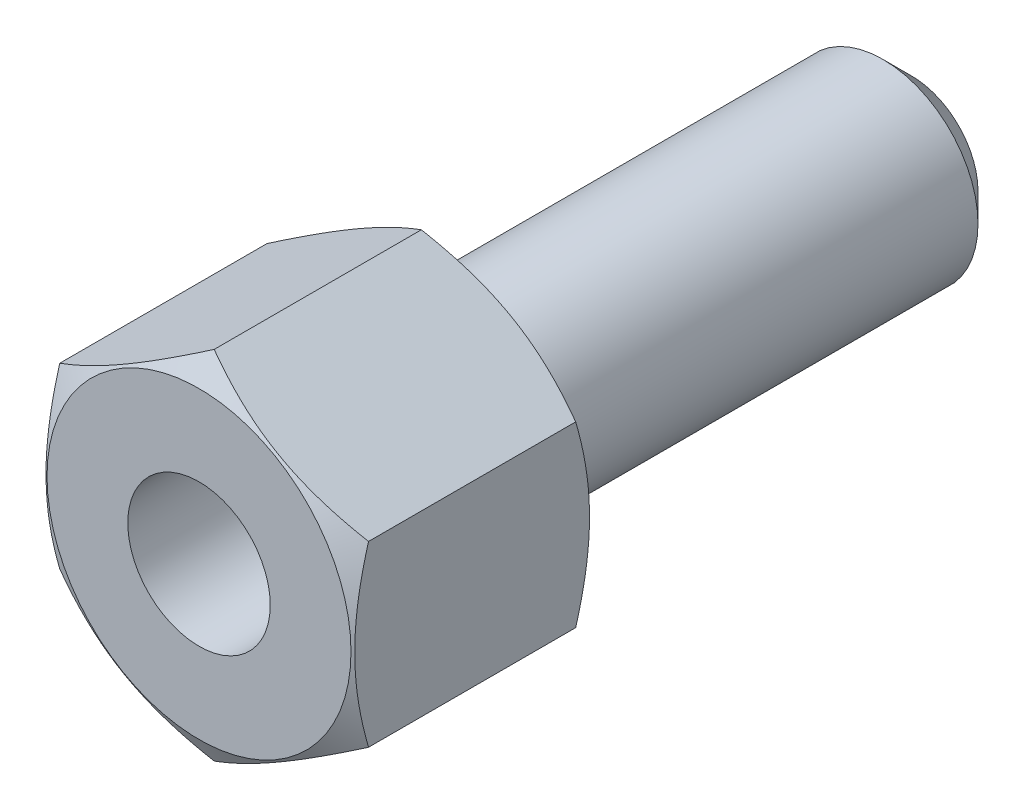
ISO-10303-21;
HEADER;
FILE_DESCRIPTION(('STEP AP214'),'2;1');
FILE_NAME('part.step','',(''),(''),'','','');
FILE_SCHEMA(('AUTOMOTIVE_DESIGN { 1 0 10303 214 1 1 1 1 }'));
ENDSEC;
DATA;
#1=APPLICATION_CONTEXT('core data for automotive mechanical design processes');
#2=APPLICATION_PROTOCOL_DEFINITION('international standard','automotive_design',2000,#1);
#3=PRODUCT_CONTEXT('',#1,'mechanical');
#4=PRODUCT('Part','Part','',(#3));
#5=PRODUCT_RELATED_PRODUCT_CATEGORY('part','',(#4));
#6=PRODUCT_DEFINITION_FORMATION('','',#4);
#7=PRODUCT_DEFINITION_CONTEXT('part definition',#1,'design');
#8=PRODUCT_DEFINITION('design','',#6,#7);
#9=PRODUCT_DEFINITION_SHAPE('','',#8);
#10=(LENGTH_UNIT() NAMED_UNIT(*) SI_UNIT(.MILLI.,.METRE.));
#11=(NAMED_UNIT(*) PLANE_ANGLE_UNIT() SI_UNIT($,.RADIAN.));
#12=(NAMED_UNIT(*) SI_UNIT($,.STERADIAN.) SOLID_ANGLE_UNIT());
#13=UNCERTAINTY_MEASURE_WITH_UNIT(LENGTH_MEASURE(1.E-05),#10,'distance_accuracy_value','');
#14=(GEOMETRIC_REPRESENTATION_CONTEXT(3) GLOBAL_UNCERTAINTY_ASSIGNED_CONTEXT((#13)) GLOBAL_UNIT_ASSIGNED_CONTEXT((#10,
#11,#12)) REPRESENTATION_CONTEXT('',''));
#15=CARTESIAN_POINT('',(0.,0.,0.));
#16=DIRECTION('',(0.,0.,1.));
#17=DIRECTION('',(1.,0.,0.));
#18=AXIS2_PLACEMENT_3D('',#15,#16,#17);
#19=CARTESIAN_POINT('',(-6.5,11.2583302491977,10.));
#20=DIRECTION('',(0.,0.,1.));
#21=DIRECTION('',(1.,0.,0.));
#22=AXIS2_PLACEMENT_3D('',#19,#20,#21);
#23=PLANE('',#22);
#24=CARTESIAN_POINT('',(0.,0.,10.));
#25=DIRECTION('',(0.,0.,-1.));
#26=DIRECTION('',(-1.,0.,0.));
#27=AXIS2_PLACEMENT_3D('',#24,#25,#26);
#28=CIRCLE('',#27,6.4);
#29=CARTESIAN_POINT('',(-6.4,0.,10.));
#30=VERTEX_POINT('',#29);
#31=EDGE_CURVE('E223',#30,#30,#28,.T.);
#32=ORIENTED_EDGE('',*,*,#31,.F.);
#33=EDGE_LOOP('',(#32));
#34=FACE_BOUND('',#33,.T.);
#35=CARTESIAN_POINT('',(0.,0.,10.));
#36=DIRECTION('',(0.,0.,1.));
#37=DIRECTION('',(1.,0.,0.));
#38=AXIS2_PLACEMENT_3D('',#35,#36,#37);
#39=CIRCLE('',#38,3.);
#40=CARTESIAN_POINT('',(3.,0.,10.));
#41=VERTEX_POINT('',#40);
#42=EDGE_CURVE('E211',#41,#41,#39,.T.);
#43=ORIENTED_EDGE('',*,*,#42,.F.);
#44=EDGE_LOOP('',(#43));
#45=FACE_BOUND('',#44,.T.);
#46=ADVANCED_FACE('F14',(#34,#45),#23,.T.);
#47=CARTESIAN_POINT('',(2.5,0.,4.));
#48=DIRECTION('',(0.,0.,-1.));
#49=DIRECTION('',(-1.,0.,0.));
#50=AXIS2_PLACEMENT_3D('',#47,#48,#49);
#51=PLANE('',#50);
#52=CARTESIAN_POINT('',(0.,0.,4.));
#53=DIRECTION('',(0.,0.,1.));
#54=DIRECTION('',(1.,0.,0.));
#55=AXIS2_PLACEMENT_3D('',#52,#53,#54);
#56=CIRCLE('',#55,3.);
#57=CARTESIAN_POINT('',(3.,0.,4.));
#58=VERTEX_POINT('',#57);
#59=EDGE_CURVE('E214',#58,#58,#56,.T.);
#60=ORIENTED_EDGE('',*,*,#59,.T.);
#61=EDGE_LOOP('',(#60));
#62=FACE_BOUND('',#61,.T.);
#63=ADVANCED_FACE('F230',(#62),#51,.F.);
#64=CARTESIAN_POINT('',(0.,0.,10.));
#65=DIRECTION('',(0.,0.,1.));
#66=DIRECTION('',(1.,0.,0.));
#67=AXIS2_PLACEMENT_3D('',#64,#65,#66);
#68=CYLINDRICAL_SURFACE('',#67,3.);
#69=ORIENTED_EDGE('',*,*,#59,.F.);
#70=EDGE_LOOP('',(#69));
#71=FACE_BOUND('',#70,.T.);
#72=ORIENTED_EDGE('',*,*,#42,.T.);
#73=EDGE_LOOP('',(#72));
#74=FACE_BOUND('',#73,.T.);
#75=ADVANCED_FACE('F233',(#71,#74),#68,.F.);
#76=CARTESIAN_POINT('',(0.,0.,10.));
#77=DIRECTION('',(0.,0.,-1.));
#78=DIRECTION('',(-1.,0.,0.));
#79=AXIS2_PLACEMENT_3D('',#76,#77,#78);
#80=CONICAL_SURFACE('',#79,6.4,1.0471975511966);
#81=ORIENTED_EDGE('',*,*,#31,.T.);
#82=EDGE_LOOP('',(#81));
#83=FACE_BOUND('',#82,.T.);
#84=CARTESIAN_POINT('',(6.5002,-3.75266127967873,9.36164172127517));
#85=CARTESIAN_POINT('',(6.35732254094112,-3.83515161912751,9.40926055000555));
#86=CARTESIAN_POINT('',(6.21391236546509,-3.91794952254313,9.45471827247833));
#87=CARTESIAN_POINT('',(5.9259273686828,-4.08421773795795,9.54071629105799));
#88=CARTESIAN_POINT('',(5.78135207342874,-4.16768832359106,9.58125446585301));
#89=CARTESIAN_POINT('',(5.34531134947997,-4.41943655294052,9.69469397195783));
#90=CARTESIAN_POINT('',(5.05212471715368,-4.5887079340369,9.7592171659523));
#91=CARTESIAN_POINT('',(4.61337625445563,-4.84201947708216,9.83487838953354));
#92=CARTESIAN_POINT('',(4.46912536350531,-4.92530276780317,9.85643211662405));
#93=CARTESIAN_POINT('',(4.17997178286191,-5.09224566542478,9.89257465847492));
#94=CARTESIAN_POINT('',(4.03506915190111,-5.17590523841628,9.90716408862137));
#95=CARTESIAN_POINT('',(3.74501222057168,-5.34336968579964,9.92900622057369));
#96=CARTESIAN_POINT('',(3.59985839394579,-5.427174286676,9.93626724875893));
#97=CARTESIAN_POINT('',(3.30942466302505,-5.59485627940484,9.9433046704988));
#98=CARTESIAN_POINT('',(3.16414476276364,-5.67873366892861,9.94308129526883));
#99=CARTESIAN_POINT('',(2.76612405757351,-5.90853103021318,9.93218151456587));
#100=CARTESIAN_POINT('',(2.51351353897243,-6.05437578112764,9.91388315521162));
#101=CARTESIAN_POINT('',(2.00997032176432,-6.34509659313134,9.85585863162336));
#102=CARTESIAN_POINT('',(1.75903939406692,-6.48997163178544,9.81611263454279));
#103=CARTESIAN_POINT('',(1.25448277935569,-6.78127752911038,9.71675906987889));
#104=CARTESIAN_POINT('',(1.0009207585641,-6.92767163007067,9.65673054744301));
#105=CARTESIAN_POINT('',(0.497578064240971,-7.21827667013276,9.52048998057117));
#106=CARTESIAN_POINT('',(0.247790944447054,-7.36249133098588,9.44430993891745));
#107=CARTESIAN_POINT('',(-0.000199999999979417,-7.50566896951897,9.36164172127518));
#108=B_SPLINE_CURVE_WITH_KNOTS('',3,(#84,#85,#86,#87,#88,#89,#90,#91,#92,#93,#94,#95,#96,#97,
#98,#99,#100,#101,#102,#103,#104,#105,#106,#107),.UNSPECIFIED.,.F.,.F.,(4,2,2,2,2,2,2,2,2,2,2,
4),(0.,0.515105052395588,1.03043143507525,2.06322554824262,2.56697389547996,3.07067772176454,
3.57380860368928,4.0769239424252,4.9527935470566,5.82947446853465,6.72559912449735,
7.61996451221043),.UNSPECIFIED.);
#109=CARTESIAN_POINT('',(6.5,-3.75277674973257,9.36170838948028));
#110=VERTEX_POINT('',#109);
#111=CARTESIAN_POINT('',(0.,-7.50555349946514,9.36170838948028));
#112=VERTEX_POINT('',#111);
#113=EDGE_CURVE('E168',#110,#112,#108,.T.);
#114=ORIENTED_EDGE('',*,*,#113,.F.);
#115=CARTESIAN_POINT('',(6.5,-10.251609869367,6.68682024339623));
#116=CARTESIAN_POINT('',(6.5,-9.96623432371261,6.82593262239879));
#117=CARTESIAN_POINT('',(6.5,-9.68022178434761,6.96375977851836));
#118=CARTESIAN_POINT('',(6.5,-9.10658461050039,7.2361240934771));
#119=CARTESIAN_POINT('',(6.5,-8.81895974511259,7.37066076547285));
#120=CARTESIAN_POINT('',(6.5,-8.24035824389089,7.63636529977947));
#121=CARTESIAN_POINT('',(6.5,-7.94937197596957,7.76751225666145));
#122=CARTESIAN_POINT('',(6.5,-7.36514418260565,8.02466325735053));
#123=CARTESIAN_POINT('',(6.5,-7.07190275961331,8.15066753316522));
#124=CARTESIAN_POINT('',(6.5,-6.47259222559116,8.40039237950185));
#125=CARTESIAN_POINT('',(6.5,-6.16642817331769,8.52388629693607));
#126=CARTESIAN_POINT('',(6.5,-5.55058155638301,8.76193539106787));
#127=CARTESIAN_POINT('',(6.5,-5.24089861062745,8.87648958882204));
#128=CARTESIAN_POINT('',(6.5,-4.61804913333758,9.0937769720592));
#129=CARTESIAN_POINT('',(6.5,-4.30489053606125,9.19653268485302));
#130=CARTESIAN_POINT('',(6.5,-3.67408052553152,9.38703841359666));
#131=CARTESIAN_POINT('',(6.5,-3.35643050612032,9.4747929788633));
#132=CARTESIAN_POINT('',(6.5,-2.71827452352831,9.63072575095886));
#133=CARTESIAN_POINT('',(6.5,-2.39779647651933,9.69901642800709));
#134=CARTESIAN_POINT('',(6.5,-1.75263546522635,9.81227512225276));
#135=CARTESIAN_POINT('',(6.5,-1.42795295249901,9.85724562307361));
#136=CARTESIAN_POINT('',(6.5,-0.941234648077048,9.90423394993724));
#137=CARTESIAN_POINT('',(6.5,-0.780147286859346,9.91646993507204));
#138=CARTESIAN_POINT('',(6.5,-0.457592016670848,9.93411753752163));
#139=CARTESIAN_POINT('',(6.5,-0.296124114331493,9.93952927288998));
#140=CARTESIAN_POINT('',(6.5,0.026894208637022,9.94339126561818));
#141=CARTESIAN_POINT('',(6.5,0.188444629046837,9.94184154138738));
#142=CARTESIAN_POINT('',(6.5,0.511333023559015,9.93182234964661));
#143=CARTESIAN_POINT('',(6.5,0.672670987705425,9.92335256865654));
#144=CARTESIAN_POINT('',(6.5,1.05534602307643,9.89523890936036));
#145=CARTESIAN_POINT('',(6.5,1.27646767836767,9.87259368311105));
#146=CARTESIAN_POINT('',(6.5,1.71717009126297,9.81550155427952));
#147=CARTESIAN_POINT('',(6.5,1.93675065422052,9.78105318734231));
#148=CARTESIAN_POINT('',(6.5,2.59287335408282,9.66182153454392));
#149=CARTESIAN_POINT('',(6.5,3.02657572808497,9.5611701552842));
#150=CARTESIAN_POINT('',(6.5,3.67531997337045,9.38535013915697));
#151=CARTESIAN_POINT('',(6.5,3.89369135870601,9.32174856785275));
#152=CARTESIAN_POINT('',(6.5,4.32831695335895,9.18761755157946));
#153=CARTESIAN_POINT('',(6.5,4.54457114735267,9.11708805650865));
#154=CARTESIAN_POINT('',(6.49999999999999,4.9750244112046,8.97025924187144));
#155=CARTESIAN_POINT('',(6.49999999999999,5.18922405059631,8.89396157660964));
#156=CARTESIAN_POINT('',(6.5,5.61582712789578,8.73652606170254));
#157=CARTESIAN_POINT('',(6.5,5.82823059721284,8.65538829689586));
#158=CARTESIAN_POINT('',(6.5,6.36609708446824,8.44401186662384));
#159=CARTESIAN_POINT('',(6.5,6.69046427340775,8.31098844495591));
#160=CARTESIAN_POINT('',(6.49999999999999,7.33609679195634,8.03759124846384));
#161=CARTESIAN_POINT('',(6.49999999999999,7.6573618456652,7.89721682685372));
#162=CARTESIAN_POINT('',(6.49999999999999,8.29743608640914,7.61072908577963));
#163=CARTESIAN_POINT('',(6.49999999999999,8.61624446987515,7.46461397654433));
#164=CARTESIAN_POINT('',(6.49999999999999,9.25175710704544,7.1679164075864));
#165=CARTESIAN_POINT('',(6.49999999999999,9.5684614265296,7.01733408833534));
#166=CARTESIAN_POINT('',(6.49999999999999,10.2005930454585,6.71239901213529));
#167=CARTESIAN_POINT('',(6.49999999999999,10.5160179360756,6.55804127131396));
#168=CARTESIAN_POINT('',(6.49999999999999,11.1454419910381,6.24644601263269));
#169=CARTESIAN_POINT('',(6.49999999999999,11.4594411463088,6.08920847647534));
#170=CARTESIAN_POINT('',(6.49999999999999,12.3995576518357,5.61406130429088));
#171=CARTESIAN_POINT('',(6.49999999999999,13.0239100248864,5.29266063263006));
#172=CARTESIAN_POINT('',(6.49999999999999,14.2096861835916,4.67456421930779));
#173=CARTESIAN_POINT('',(6.49999999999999,14.7714135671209,4.37844811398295));
#174=CARTESIAN_POINT('',(6.49999999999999,15.8928454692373,3.78234532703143));
#175=CARTESIAN_POINT('',(6.49999999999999,16.4525498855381,3.48235845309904));
#176=CARTESIAN_POINT('',(6.49999999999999,17.5686872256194,2.88040486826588));
#177=CARTESIAN_POINT('',(6.49999999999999,18.1251249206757,2.57844698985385));
#178=CARTESIAN_POINT('',(6.49999999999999,19.2367261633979,1.97228506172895));
#179=CARTESIAN_POINT('',(6.49999999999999,19.7918897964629,1.66808116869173));
#180=CARTESIAN_POINT('',(6.5,20.3465961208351,1.36305116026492));
#181=B_SPLINE_CURVE_WITH_KNOTS('',3,(#115,#116,#117,#118,#119,#120,#121,#122,#123,#124,#125,
#126,#127,#128,#129,#130,#131,#132,#133,#134,#135,#136,#137,#138,#139,#140,#141,#142,#143,#144,
#145,#146,#147,#148,#149,#150,#151,#152,#153,#154,#155,#156,#157,#158,#159,#160,#161,#162,#163,
#164,#165,#166,#167,#168,#169,#170,#171,#172,#173,#174,#175,#176,#177,#178,#179,#180),
.UNSPECIFIED.,.F.,.F.,(4,2,2,2,2,2,2,2,2,2,2,2,2,2,2,2,2,2,2,2,2,2,2,2,2,2,2,2,2,2,2,2,4),(0.,
0.952440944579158,1.90502196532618,2.86250633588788,3.81994746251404,4.81023576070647,
5.80063234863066,6.78910533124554,7.77727801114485,8.75961916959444,9.74185568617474,
10.2263873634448,10.7109106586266,11.1954326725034,11.6799766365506,12.3464382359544,
13.0129825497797,14.3467327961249,15.0290060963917,15.7112843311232,16.3933676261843,
17.0754389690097,18.1270626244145,19.1787789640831,20.2308258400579,21.2828396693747,
22.336326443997,23.3898199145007,25.4964198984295,27.4013980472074,29.3064712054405,
31.2057322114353,33.1048619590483),.UNSPECIFIED.);
#182=CARTESIAN_POINT('',(6.5,3.75277674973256,9.36170838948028));
#183=VERTEX_POINT('',#182);
#184=EDGE_CURVE('E159',#183,#110,#181,.F.);
#185=ORIENTED_EDGE('',*,*,#184,.F.);
#186=CARTESIAN_POINT('',(-0.000200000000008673,7.50566896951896,9.36164172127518));
#187=CARTESIAN_POINT('',(0.142677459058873,7.42317863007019,9.40926055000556));
#188=CARTESIAN_POINT('',(0.286087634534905,7.34038072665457,9.45471827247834));
#189=CARTESIAN_POINT('',(0.574072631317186,7.17411251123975,9.540716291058));
#190=CARTESIAN_POINT('',(0.718647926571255,7.09064192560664,9.58125446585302));
#191=CARTESIAN_POINT('',(1.15468865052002,6.83889369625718,9.69469397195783));
#192=CARTESIAN_POINT('',(1.44787528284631,6.6696223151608,9.7592171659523));
#193=CARTESIAN_POINT('',(1.88662374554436,6.41631077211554,9.83487838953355));
#194=CARTESIAN_POINT('',(2.03087463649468,6.33302748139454,9.85643211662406));
#195=CARTESIAN_POINT('',(2.32002821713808,6.16608458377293,9.89257465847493));
#196=CARTESIAN_POINT('',(2.46493084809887,6.08242501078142,9.90716408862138));
#197=CARTESIAN_POINT('',(2.7549877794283,5.91496056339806,9.9290062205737));
#198=CARTESIAN_POINT('',(2.90014160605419,5.8311559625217,9.93626724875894));
#199=CARTESIAN_POINT('',(3.19057533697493,5.66347396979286,9.94330467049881));
#200=CARTESIAN_POINT('',(3.33585523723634,5.5795965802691,9.94308129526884));
#201=CARTESIAN_POINT('',(3.73387594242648,5.34979921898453,9.93218151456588));
#202=CARTESIAN_POINT('',(3.98648646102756,5.20395446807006,9.91388315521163));
#203=CARTESIAN_POINT('',(4.49002967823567,4.91323365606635,9.85585863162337));
#204=CARTESIAN_POINT('',(4.74096060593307,4.76835861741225,9.8161126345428));
#205=CARTESIAN_POINT('',(5.24551722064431,4.47705272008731,9.7167590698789));
#206=CARTESIAN_POINT('',(5.49907924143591,4.33065861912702,9.65673054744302));
#207=CARTESIAN_POINT('',(6.00242193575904,4.04005357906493,9.52048998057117));
#208=CARTESIAN_POINT('',(6.25220905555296,3.89583891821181,9.44430993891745));
#209=CARTESIAN_POINT('',(6.5002,3.75266127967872,9.36164172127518));
#210=B_SPLINE_CURVE_WITH_KNOTS('',3,(#186,#187,#188,#189,#190,#191,#192,#193,#194,#195,#196,
#197,#198,#199,#200,#201,#202,#203,#204,#205,#206,#207,#208,#209),.UNSPECIFIED.,.F.,.F.,(4,2,2,
2,2,2,2,2,2,2,2,4),(0.,0.515105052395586,1.03043143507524,2.06322554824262,2.56697389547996,
3.07067772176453,3.57380860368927,4.07692394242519,4.95279354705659,5.82947446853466,
6.72559912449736,7.61996451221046),.UNSPECIFIED.);
#211=CARTESIAN_POINT('',(0.,7.50555349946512,9.36170838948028));
#212=VERTEX_POINT('',#211);
#213=EDGE_CURVE('E167',#212,#183,#210,.T.);
#214=ORIENTED_EDGE('',*,*,#213,.F.);
#215=CARTESIAN_POINT('',(-6.5002,3.75266127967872,9.36164172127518));
#216=CARTESIAN_POINT('',(-6.35732254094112,3.83515161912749,9.40926055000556));
#217=CARTESIAN_POINT('',(-6.21391236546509,3.91794952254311,9.45471827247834));
#218=CARTESIAN_POINT('',(-5.9259273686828,4.08421773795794,9.540716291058));
#219=CARTESIAN_POINT('',(-5.78135207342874,4.16768832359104,9.58125446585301));
#220=CARTESIAN_POINT('',(-5.34531134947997,4.4194365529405,9.69469397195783));
#221=CARTESIAN_POINT('',(-5.05212471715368,4.58870793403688,9.7592171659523));
#222=CARTESIAN_POINT('',(-4.61337625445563,4.84201947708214,9.83487838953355));
#223=CARTESIAN_POINT('',(-4.46912536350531,4.92530276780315,9.85643211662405));
#224=CARTESIAN_POINT('',(-4.17997178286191,5.09224566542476,9.89257465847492));
#225=CARTESIAN_POINT('',(-4.03506915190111,5.17590523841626,9.90716408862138));
#226=CARTESIAN_POINT('',(-3.74501222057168,5.34336968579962,9.9290062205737));
#227=CARTESIAN_POINT('',(-3.59985839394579,5.42717428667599,9.93626724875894));
#228=CARTESIAN_POINT('',(-3.30942466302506,5.59485627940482,9.94330467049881));
#229=CARTESIAN_POINT('',(-3.16414476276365,5.67873366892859,9.94308129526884));
#230=CARTESIAN_POINT('',(-2.76612405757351,5.90853103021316,9.93218151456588));
#231=CARTESIAN_POINT('',(-2.51351353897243,6.05437578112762,9.91388315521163));
#232=CARTESIAN_POINT('',(-2.00997032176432,6.34509659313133,9.85585863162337));
#233=CARTESIAN_POINT('',(-1.75903939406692,6.48997163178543,9.8161126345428));
#234=CARTESIAN_POINT('',(-1.25448277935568,6.78127752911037,9.7167590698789));
#235=CARTESIAN_POINT('',(-1.00092075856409,6.92767163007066,9.65673054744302));
#236=CARTESIAN_POINT('',(-0.49757806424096,7.21827667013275,9.52048998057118));
#237=CARTESIAN_POINT('',(-0.247790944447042,7.36249133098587,9.44430993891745));
#238=CARTESIAN_POINT('',(0.000199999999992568,7.50566896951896,9.36164172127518));
#239=B_SPLINE_CURVE_WITH_KNOTS('',3,(#215,#216,#217,#218,#219,#220,#221,#222,#223,#224,#225,
#226,#227,#228,#229,#230,#231,#232,#233,#234,#235,#236,#237,#238),.UNSPECIFIED.,.F.,.F.,(4,2,2,
2,2,2,2,2,2,2,2,4),(0.,0.515105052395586,1.03043143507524,2.06322554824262,2.56697389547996,
3.07067772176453,3.57380860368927,4.07692394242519,4.95279354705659,5.82947446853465,
6.72559912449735,7.61996451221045),.UNSPECIFIED.);
#240=CARTESIAN_POINT('',(-6.5,3.75277674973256,9.36170838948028));
#241=VERTEX_POINT('',#240);
#242=EDGE_CURVE('E179',#241,#212,#239,.T.);
#243=ORIENTED_EDGE('',*,*,#242,.F.);
#244=CARTESIAN_POINT('',(-6.5,-10.251609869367,6.68682024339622));
#245=CARTESIAN_POINT('',(-6.5,-9.96623432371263,6.82593262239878));
#246=CARTESIAN_POINT('',(-6.50000000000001,-9.68022178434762,6.96375977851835));
#247=CARTESIAN_POINT('',(-6.50000000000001,-9.10658461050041,7.23612409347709));
#248=CARTESIAN_POINT('',(-6.50000000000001,-8.81895974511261,7.37066076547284));
#249=CARTESIAN_POINT('',(-6.50000000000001,-8.2403582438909,7.63636529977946));
#250=CARTESIAN_POINT('',(-6.50000000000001,-7.94937197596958,7.76751225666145));
#251=CARTESIAN_POINT('',(-6.50000000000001,-7.36514418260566,8.02466325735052));
#252=CARTESIAN_POINT('',(-6.50000000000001,-7.07190275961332,8.15066753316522));
#253=CARTESIAN_POINT('',(-6.50000000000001,-6.47259222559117,8.40039237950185));
#254=CARTESIAN_POINT('',(-6.5,-6.1664281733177,8.52388629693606));
#255=CARTESIAN_POINT('',(-6.5,-5.55058155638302,8.76193539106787));
#256=CARTESIAN_POINT('',(-6.5,-5.24089861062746,8.87648958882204));
#257=CARTESIAN_POINT('',(-6.5,-4.61804913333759,9.09377697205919));
#258=CARTESIAN_POINT('',(-6.5,-4.30489053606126,9.19653268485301));
#259=CARTESIAN_POINT('',(-6.5,-3.67408052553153,9.38703841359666));
#260=CARTESIAN_POINT('',(-6.5,-3.35643050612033,9.4747929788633));
#261=CARTESIAN_POINT('',(-6.5,-2.71827452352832,9.63072575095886));
#262=CARTESIAN_POINT('',(-6.5,-2.39779647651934,9.69901642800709));
#263=CARTESIAN_POINT('',(-6.5,-1.75263546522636,9.81227512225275));
#264=CARTESIAN_POINT('',(-6.5,-1.42795295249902,9.85724562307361));
#265=CARTESIAN_POINT('',(-6.5,-0.941234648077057,9.90423394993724));
#266=CARTESIAN_POINT('',(-6.5,-0.780147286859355,9.91646993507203));
#267=CARTESIAN_POINT('',(-6.5,-0.457592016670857,9.93411753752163));
#268=CARTESIAN_POINT('',(-6.5,-0.296124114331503,9.93952927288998));
#269=CARTESIAN_POINT('',(-6.5,0.026894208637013,9.94339126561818));
#270=CARTESIAN_POINT('',(-6.5,0.188444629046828,9.94184154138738));
#271=CARTESIAN_POINT('',(-6.5,0.511333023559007,9.9318223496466));
#272=CARTESIAN_POINT('',(-6.5,0.672670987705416,9.92335256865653));
#273=CARTESIAN_POINT('',(-6.5,1.05534602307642,9.89523890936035));
#274=CARTESIAN_POINT('',(-6.5,1.27646767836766,9.87259368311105));
#275=CARTESIAN_POINT('',(-6.5,1.71717009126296,9.81550155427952));
#276=CARTESIAN_POINT('',(-6.5,1.93675065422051,9.78105318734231));
#277=CARTESIAN_POINT('',(-6.5,2.59287335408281,9.66182153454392));
#278=CARTESIAN_POINT('',(-6.5,3.02657572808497,9.5611701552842));
#279=CARTESIAN_POINT('',(-6.5,3.67531997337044,9.38535013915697));
#280=CARTESIAN_POINT('',(-6.5,3.89369135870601,9.32174856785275));
#281=CARTESIAN_POINT('',(-6.5,4.32831695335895,9.18761755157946));
#282=CARTESIAN_POINT('',(-6.5,4.54457114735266,9.11708805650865));
#283=CARTESIAN_POINT('',(-6.5,4.97502441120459,8.97025924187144));
#284=CARTESIAN_POINT('',(-6.5,5.1892240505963,8.89396157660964));
#285=CARTESIAN_POINT('',(-6.5,5.61582712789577,8.73652606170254));
#286=CARTESIAN_POINT('',(-6.5,5.82823059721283,8.65538829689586));
#287=CARTESIAN_POINT('',(-6.5,6.36609708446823,8.44401186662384));
#288=CARTESIAN_POINT('',(-6.5,6.69046427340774,8.31098844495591));
#289=CARTESIAN_POINT('',(-6.5,7.33609679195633,8.03759124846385));
#290=CARTESIAN_POINT('',(-6.5,7.65736184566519,7.89721682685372));
#291=CARTESIAN_POINT('',(-6.5,8.29743608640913,7.61072908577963));
#292=CARTESIAN_POINT('',(-6.5,8.61624446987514,7.46461397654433));
#293=CARTESIAN_POINT('',(-6.5,9.25175710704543,7.16791640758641));
#294=CARTESIAN_POINT('',(-6.5,9.56846142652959,7.01733408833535));
#295=CARTESIAN_POINT('',(-6.5,10.2005930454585,6.7123990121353));
#296=CARTESIAN_POINT('',(-6.5,10.5160179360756,6.55804127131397));
#297=CARTESIAN_POINT('',(-6.5,11.1454419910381,6.2464460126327));
#298=CARTESIAN_POINT('',(-6.5,11.4594411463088,6.08920847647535));
#299=CARTESIAN_POINT('',(-6.5,12.3995576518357,5.61406130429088));
#300=CARTESIAN_POINT('',(-6.5,13.0239100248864,5.29266063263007));
#301=CARTESIAN_POINT('',(-6.5,14.2096861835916,4.6745642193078));
#302=CARTESIAN_POINT('',(-6.49999999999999,14.7714135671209,4.37844811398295));
#303=CARTESIAN_POINT('',(-6.49999999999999,15.8928454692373,3.78234532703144));
#304=CARTESIAN_POINT('',(-6.49999999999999,16.4525498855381,3.48235845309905));
#305=CARTESIAN_POINT('',(-6.49999999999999,17.5686872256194,2.88040486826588));
#306=CARTESIAN_POINT('',(-6.49999999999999,18.1251249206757,2.57844698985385));
#307=CARTESIAN_POINT('',(-6.49999999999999,19.2367261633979,1.97228506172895));
#308=CARTESIAN_POINT('',(-6.5,19.7918897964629,1.66808116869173));
#309=CARTESIAN_POINT('',(-6.5,20.3465961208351,1.36305116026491));
#310=B_SPLINE_CURVE_WITH_KNOTS('',3,(#244,#245,#246,#247,#248,#249,#250,#251,#252,#253,#254,
#255,#256,#257,#258,#259,#260,#261,#262,#263,#264,#265,#266,#267,#268,#269,#270,#271,#272,#273,
#274,#275,#276,#277,#278,#279,#280,#281,#282,#283,#284,#285,#286,#287,#288,#289,#290,#291,#292,
#293,#294,#295,#296,#297,#298,#299,#300,#301,#302,#303,#304,#305,#306,#307,#308,#309),
.UNSPECIFIED.,.F.,.F.,(4,2,2,2,2,2,2,2,2,2,2,2,2,2,2,2,2,2,2,2,2,2,2,2,2,2,2,2,2,2,2,2,4),(0.,
0.95244094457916,1.90502196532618,2.86250633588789,3.81994746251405,4.81023576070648,
5.80063234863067,6.78910533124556,7.77727801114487,8.75961916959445,9.74185568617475,
10.2263873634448,10.7109106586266,11.1954326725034,11.6799766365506,12.3464382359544,
13.0129825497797,14.346732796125,15.0290060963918,15.7112843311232,16.3933676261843,
17.0754389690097,18.1270626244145,19.1787789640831,20.230825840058,21.2828396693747,
22.336326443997,23.3898199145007,25.4964198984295,27.4013980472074,29.3064712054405,
31.2057322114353,33.1048619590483),.UNSPECIFIED.);
#311=CARTESIAN_POINT('',(-6.5,-3.75277674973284,9.36170838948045));
#312=VERTEX_POINT('',#311);
#313=EDGE_CURVE('E197',#312,#241,#310,.T.);
#314=ORIENTED_EDGE('',*,*,#313,.F.);
#315=CARTESIAN_POINT('',(0.00020000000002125,-7.50566896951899,9.36164172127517));
#316=CARTESIAN_POINT('',(-0.142677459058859,-7.42317863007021,9.40926055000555));
#317=CARTESIAN_POINT('',(-0.286087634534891,-7.34038072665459,9.45471827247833));
#318=CARTESIAN_POINT('',(-0.574072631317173,-7.17411251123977,9.54071629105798));
#319=CARTESIAN_POINT('',(-0.718647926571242,-7.09064192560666,9.58125446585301));
#320=CARTESIAN_POINT('',(-1.15468865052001,-6.8388936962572,9.69469397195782));
#321=CARTESIAN_POINT('',(-1.4478752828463,-6.66962231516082,9.75921716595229));
#322=CARTESIAN_POINT('',(-1.88662374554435,-6.41631077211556,9.83487838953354));
#323=CARTESIAN_POINT('',(-2.03087463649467,-6.33302748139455,9.85643211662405));
#324=CARTESIAN_POINT('',(-2.32002821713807,-6.16608458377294,9.89257465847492));
#325=CARTESIAN_POINT('',(-2.46493084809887,-6.08242501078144,9.90716408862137));
#326=CARTESIAN_POINT('',(-2.7549877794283,-5.91496056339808,9.92900622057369));
#327=CARTESIAN_POINT('',(-2.90014160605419,-5.83115596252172,9.93626724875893));
#328=CARTESIAN_POINT('',(-3.19057533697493,-5.66347396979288,9.9433046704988));
#329=CARTESIAN_POINT('',(-3.33585523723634,-5.57959658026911,9.94308129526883));
#330=CARTESIAN_POINT('',(-3.73387594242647,-5.34979921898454,9.93218151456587));
#331=CARTESIAN_POINT('',(-3.98648646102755,-5.20395446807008,9.91388315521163));
#332=CARTESIAN_POINT('',(-4.49002967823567,-4.91323365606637,9.85585863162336));
#333=CARTESIAN_POINT('',(-4.74096060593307,-4.76835861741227,9.8161126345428));
#334=CARTESIAN_POINT('',(-5.24551722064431,-4.47705272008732,9.71675906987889));
#335=CARTESIAN_POINT('',(-5.49907924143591,-4.33065861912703,9.65673054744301));
#336=CARTESIAN_POINT('',(-6.00242193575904,-4.04005357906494,9.52048998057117));
#337=CARTESIAN_POINT('',(-6.25220905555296,-3.89583891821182,9.44430993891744));
#338=CARTESIAN_POINT('',(-6.5002,-3.75266127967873,9.36164172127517));
#339=B_SPLINE_CURVE_WITH_KNOTS('',3,(#315,#316,#317,#318,#319,#320,#321,#322,#323,#324,#325,
#326,#327,#328,#329,#330,#331,#332,#333,#334,#335,#336,#337,#338),.UNSPECIFIED.,.F.,.F.,(4,2,2,
2,2,2,2,2,2,2,2,4),(0.,0.515105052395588,1.03043143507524,2.06322554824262,2.56697389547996,
3.07067772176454,3.57380860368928,4.0769239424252,4.95279354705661,5.82947446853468,
6.72559912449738,7.61996451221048),.UNSPECIFIED.);
#340=EDGE_CURVE('E37',#112,#312,#339,.T.);
#341=ORIENTED_EDGE('',*,*,#340,.F.);
#342=EDGE_LOOP('',(#114,#185,#214,#243,#314,#341));
#343=FACE_BOUND('',#342,.T.);
#344=ADVANCED_FACE('F109',(#83,#343),#80,.T.);
#345=CARTESIAN_POINT('',(0.,-7.50555349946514,10.));
#346=DIRECTION('',(-0.5,0.866025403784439,0.));
#347=DIRECTION('',(-0.866025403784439,-0.5,0.));
#348=AXIS2_PLACEMENT_3D('',#345,#346,#347);
#349=PLANE('',#348);
#350=DIRECTION('',(0.,0.,-1.));
#351=VECTOR('',#350,1.);
#352=CARTESIAN_POINT('',(0.,-7.50555349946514,10.));
#353=LINE('',#352,#351);
#354=CARTESIAN_POINT('',(0.,-7.50555349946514,0.638291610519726));
#355=VERTEX_POINT('',#354);
#356=EDGE_CURVE('E87',#112,#355,#353,.T.);
#357=ORIENTED_EDGE('',*,*,#356,.T.);
#358=CARTESIAN_POINT('',(-0.000199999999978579,-7.50566896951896,0.638358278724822));
#359=CARTESIAN_POINT('',(0.1426774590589,-7.42317863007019,0.590739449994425));
#360=CARTESIAN_POINT('',(0.286087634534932,-7.34038072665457,0.54528172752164));
#361=CARTESIAN_POINT('',(0.574072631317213,-7.17411251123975,0.459283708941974));
#362=CARTESIAN_POINT('',(0.718647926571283,-7.09064192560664,0.418745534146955));
#363=CARTESIAN_POINT('',(1.15468865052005,-6.83889369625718,0.305306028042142));
#364=CARTESIAN_POINT('',(1.44787528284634,-6.6696223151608,0.240782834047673));
#365=CARTESIAN_POINT('',(1.88662374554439,-6.41631077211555,0.165121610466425));
#366=CARTESIAN_POINT('',(2.03087463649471,-6.33302748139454,0.14356788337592));
#367=CARTESIAN_POINT('',(2.3200282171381,-6.16608458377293,0.107425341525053));
#368=CARTESIAN_POINT('',(2.4649308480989,-6.08242501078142,0.0928359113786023));
#369=CARTESIAN_POINT('',(2.75498777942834,-5.91496056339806,0.0709937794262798));
#370=CARTESIAN_POINT('',(2.90014160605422,-5.8311559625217,0.0637327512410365));
#371=CARTESIAN_POINT('',(3.19057533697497,-5.66347396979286,0.0566953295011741));
#372=CARTESIAN_POINT('',(3.33585523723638,-5.5795965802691,0.0569187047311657));
#373=CARTESIAN_POINT('',(3.73387594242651,-5.34979921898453,0.0678184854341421));
#374=CARTESIAN_POINT('',(3.98648646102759,-5.20395446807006,0.0861168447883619));
#375=CARTESIAN_POINT('',(4.4900296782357,-4.91323365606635,0.144141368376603));
#376=CARTESIAN_POINT('',(4.7409606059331,-4.76835861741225,0.18388736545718));
#377=CARTESIAN_POINT('',(5.24551722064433,-4.47705272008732,0.28324093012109));
#378=CARTESIAN_POINT('',(5.49907924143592,-4.33065861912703,0.343269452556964));
#379=CARTESIAN_POINT('',(6.00242193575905,-4.04005357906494,0.479510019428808));
#380=CARTESIAN_POINT('',(6.25220905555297,-3.89583891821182,0.555690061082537));
#381=CARTESIAN_POINT('',(6.5002,-3.75266127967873,0.638358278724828));
#382=B_SPLINE_CURVE_WITH_KNOTS('',3,(#358,#359,#360,#361,#362,#363,#364,#365,#366,#367,#368,
#369,#370,#371,#372,#373,#374,#375,#376,#377,#378,#379,#380,#381),.UNSPECIFIED.,.F.,.F.,(4,2,2,
2,2,2,2,2,2,2,2,4),(0.,0.515105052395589,1.03043143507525,2.06322554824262,2.56697389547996,
3.07067772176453,3.57380860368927,4.0769239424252,4.9527935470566,5.82947446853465,
6.72559912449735,7.61996451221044),.UNSPECIFIED.);
#383=CARTESIAN_POINT('',(6.5,-3.75277674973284,0.638291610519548));
#384=VERTEX_POINT('',#383);
#385=EDGE_CURVE('E29',#355,#384,#382,.T.);
#386=ORIENTED_EDGE('',*,*,#385,.T.);
#387=DIRECTION('',(0.,0.,-1.));
#388=VECTOR('',#387,1.);
#389=CARTESIAN_POINT('',(6.5,-3.75277674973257,10.));
#390=LINE('',#389,#388);
#391=EDGE_CURVE('E90',#110,#384,#390,.T.);
#392=ORIENTED_EDGE('',*,*,#391,.F.);
#393=ORIENTED_EDGE('',*,*,#113,.T.);
#394=EDGE_LOOP('',(#357,#386,#392,#393));
#395=FACE_BOUND('',#394,.T.);
#396=ADVANCED_FACE('F153',(#395),#349,.F.);
#397=CARTESIAN_POINT('',(6.5,-3.75277674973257,10.));
#398=DIRECTION('',(-1.,0.,0.));
#399=DIRECTION('',(0.,-1.,0.));
#400=AXIS2_PLACEMENT_3D('',#397,#398,#399);
#401=PLANE('',#400);
#402=ORIENTED_EDGE('',*,*,#391,.T.);
#403=CARTESIAN_POINT('',(6.5,-10.251609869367,3.31317975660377));
#404=CARTESIAN_POINT('',(6.5,-9.96623432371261,3.1740673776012));
#405=CARTESIAN_POINT('',(6.5,-9.68022178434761,3.03624022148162));
#406=CARTESIAN_POINT('',(6.5,-9.1065846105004,2.76387590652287));
#407=CARTESIAN_POINT('',(6.5,-8.8189597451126,2.62933923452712));
#408=CARTESIAN_POINT('',(6.5,-8.24035824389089,2.3636347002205));
#409=CARTESIAN_POINT('',(6.5,-7.94937197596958,2.23248774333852));
#410=CARTESIAN_POINT('',(6.5,-7.36514418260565,1.97533674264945));
#411=CARTESIAN_POINT('',(6.5,-7.07190275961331,1.84933246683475));
#412=CARTESIAN_POINT('',(6.5,-6.47259222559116,1.59960762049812));
#413=CARTESIAN_POINT('',(6.5,-6.1664281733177,1.47611370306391));
#414=CARTESIAN_POINT('',(6.5,-5.55058155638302,1.2380646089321));
#415=CARTESIAN_POINT('',(6.5,-5.24089861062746,1.12351041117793));
#416=CARTESIAN_POINT('',(6.5,-4.61804913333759,0.906223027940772));
#417=CARTESIAN_POINT('',(6.5,-4.30489053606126,0.803467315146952));
#418=CARTESIAN_POINT('',(6.5,-3.67408052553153,0.61296158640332));
#419=CARTESIAN_POINT('',(6.5,-3.35643050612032,0.525207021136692));
#420=CARTESIAN_POINT('',(6.5,-2.71827452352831,0.369274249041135));
#421=CARTESIAN_POINT('',(6.5,-2.39779647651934,0.300983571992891));
#422=CARTESIAN_POINT('',(6.5,-1.75263546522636,0.187724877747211));
#423=CARTESIAN_POINT('',(6.5,-1.42795295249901,0.142754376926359));
#424=CARTESIAN_POINT('',(6.5,-0.94123464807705,0.0957660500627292));
#425=CARTESIAN_POINT('',(6.5,-0.780147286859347,0.0835300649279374));
#426=CARTESIAN_POINT('',(6.5,-0.457592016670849,0.0658824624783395));
#427=CARTESIAN_POINT('',(6.5,-0.296124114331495,0.0604707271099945));
#428=CARTESIAN_POINT('',(6.5,0.0268942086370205,0.0566087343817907));
#429=CARTESIAN_POINT('',(6.5,0.188444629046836,0.0581584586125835));
#430=CARTESIAN_POINT('',(6.5,0.511333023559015,0.0681776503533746));
#431=CARTESIAN_POINT('',(6.5,0.672670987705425,0.0766474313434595));
#432=CARTESIAN_POINT('',(6.5,1.05534602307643,0.104761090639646));
#433=CARTESIAN_POINT('',(6.5,1.27646767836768,0.127406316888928));
#434=CARTESIAN_POINT('',(6.5,1.71717009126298,0.184498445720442));
#435=CARTESIAN_POINT('',(6.5,1.93675065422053,0.218946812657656));
#436=CARTESIAN_POINT('',(6.5,2.59287335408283,0.338178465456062));
#437=CARTESIAN_POINT('',(6.5,3.02657572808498,0.438829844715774));
#438=CARTESIAN_POINT('',(6.5,3.67531997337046,0.614649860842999));
#439=CARTESIAN_POINT('',(6.5,3.89369135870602,0.678251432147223));
#440=CARTESIAN_POINT('',(6.5,4.32831695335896,0.812382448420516));
#441=CARTESIAN_POINT('',(6.5,4.54457114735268,0.882911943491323));
#442=CARTESIAN_POINT('',(6.49999999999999,4.9750244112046,1.02974075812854));
#443=CARTESIAN_POINT('',(6.49999999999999,5.18922405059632,1.10603842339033));
#444=CARTESIAN_POINT('',(6.5,5.61582712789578,1.26347393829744));
#445=CARTESIAN_POINT('',(6.5,5.82823059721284,1.34461170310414));
#446=CARTESIAN_POINT('',(6.5,6.36609708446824,1.55598813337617));
#447=CARTESIAN_POINT('',(6.5,6.69046427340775,1.68901155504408));
#448=CARTESIAN_POINT('',(6.49999999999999,7.33609679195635,1.96240875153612));
#449=CARTESIAN_POINT('',(6.49999999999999,7.65736184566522,2.10278317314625));
#450=CARTESIAN_POINT('',(6.49999999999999,8.29743608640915,2.38927091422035));
#451=CARTESIAN_POINT('',(6.49999999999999,8.61624446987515,2.53538602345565));
#452=CARTESIAN_POINT('',(6.49999999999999,9.25175710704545,2.83208359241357));
#453=CARTESIAN_POINT('',(6.49999999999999,9.56846142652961,2.98266591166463));
#454=CARTESIAN_POINT('',(6.49999999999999,10.2005930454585,3.28760098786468));
#455=CARTESIAN_POINT('',(6.49999999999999,10.5160179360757,3.44195872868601));
#456=CARTESIAN_POINT('',(6.49999999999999,11.1454419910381,3.75355398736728));
#457=CARTESIAN_POINT('',(6.49999999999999,11.4594411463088,3.91079152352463));
#458=CARTESIAN_POINT('',(6.49999999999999,12.3995576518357,4.3859386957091));
#459=CARTESIAN_POINT('',(6.49999999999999,13.0239100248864,4.70733936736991));
#460=CARTESIAN_POINT('',(6.49999999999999,14.2096861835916,5.32543578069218));
#461=CARTESIAN_POINT('',(6.49999999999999,14.7714135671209,5.62155188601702));
#462=CARTESIAN_POINT('',(6.49999999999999,15.8928454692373,6.21765467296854));
#463=CARTESIAN_POINT('',(6.49999999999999,16.4525498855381,6.51764154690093));
#464=CARTESIAN_POINT('',(6.49999999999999,17.5686872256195,7.1195951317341));
#465=CARTESIAN_POINT('',(6.49999999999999,18.1251249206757,7.42155301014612));
#466=CARTESIAN_POINT('',(6.49999999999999,19.2367261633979,8.02771493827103));
#467=CARTESIAN_POINT('',(6.49999999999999,19.7918897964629,8.33191883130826));
#468=CARTESIAN_POINT('',(6.5,20.3465961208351,8.63694883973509));
#469=B_SPLINE_CURVE_WITH_KNOTS('',3,(#403,#404,#405,#406,#407,#408,#409,#410,#411,#412,#413,
#414,#415,#416,#417,#418,#419,#420,#421,#422,#423,#424,#425,#426,#427,#428,#429,#430,#431,#432,
#433,#434,#435,#436,#437,#438,#439,#440,#441,#442,#443,#444,#445,#446,#447,#448,#449,#450,#451,
#452,#453,#454,#455,#456,#457,#458,#459,#460,#461,#462,#463,#464,#465,#466,#467,#468),
.UNSPECIFIED.,.F.,.F.,(4,2,2,2,2,2,2,2,2,2,2,2,2,2,2,2,2,2,2,2,2,2,2,2,2,2,2,2,2,2,2,2,4),(0.,
0.952440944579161,1.90502196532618,2.86250633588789,3.81994746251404,4.81023576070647,
5.80063234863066,6.78910533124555,7.77727801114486,8.75961916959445,9.74185568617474,
10.2263873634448,10.7109106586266,11.1954326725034,11.6799766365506,12.3464382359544,
13.0129825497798,14.346732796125,15.0290060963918,15.7112843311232,16.3933676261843,
17.0754389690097,18.1270626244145,19.1787789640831,20.230825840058,21.2828396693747,
22.336326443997,23.3898199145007,25.4964198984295,27.4013980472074,29.3064712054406,
31.2057322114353,33.1048619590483),.UNSPECIFIED.);
#470=CARTESIAN_POINT('',(6.5,3.75277674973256,0.638291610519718));
#471=VERTEX_POINT('',#470);
#472=EDGE_CURVE('E136',#384,#471,#469,.T.);
#473=ORIENTED_EDGE('',*,*,#472,.T.);
#474=DIRECTION('',(0.,0.,-1.));
#475=VECTOR('',#474,1.);
#476=CARTESIAN_POINT('',(6.5,3.75277674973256,10.));
#477=LINE('',#476,#475);
#478=EDGE_CURVE('E217',#183,#471,#477,.T.);
#479=ORIENTED_EDGE('',*,*,#478,.F.);
#480=ORIENTED_EDGE('',*,*,#184,.T.);
#481=EDGE_LOOP('',(#402,#473,#479,#480));
#482=FACE_BOUND('',#481,.T.);
#483=ADVANCED_FACE('F148',(#482),#401,.F.);
#484=CARTESIAN_POINT('',(6.5,3.75277674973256,10.));
#485=DIRECTION('',(-0.5,-0.866025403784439,0.));
#486=DIRECTION('',(0.866025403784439,-0.5,0.));
#487=AXIS2_PLACEMENT_3D('',#484,#485,#486);
#488=PLANE('',#487);
#489=ORIENTED_EDGE('',*,*,#478,.T.);
#490=CARTESIAN_POINT('',(6.5002,3.75266127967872,0.638358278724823));
#491=CARTESIAN_POINT('',(6.35732254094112,3.83515161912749,0.590739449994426));
#492=CARTESIAN_POINT('',(6.21391236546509,3.91794952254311,0.54528172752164));
#493=CARTESIAN_POINT('',(5.92592736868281,4.08421773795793,0.459283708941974));
#494=CARTESIAN_POINT('',(5.78135207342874,4.16768832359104,0.418745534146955));
#495=CARTESIAN_POINT('',(5.34531134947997,4.4194365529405,0.305306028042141));
#496=CARTESIAN_POINT('',(5.05212471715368,4.58870793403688,0.24078283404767));
#497=CARTESIAN_POINT('',(4.61337625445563,4.84201947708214,0.16512161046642));
#498=CARTESIAN_POINT('',(4.46912536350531,4.92530276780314,0.143567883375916));
#499=CARTESIAN_POINT('',(4.17997178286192,5.09224566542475,0.107425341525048));
#500=CARTESIAN_POINT('',(4.03506915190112,5.17590523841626,0.0928359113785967));
#501=CARTESIAN_POINT('',(3.74501222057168,5.34336968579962,0.0709937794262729));
#502=CARTESIAN_POINT('',(3.59985839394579,5.42717428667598,0.0637327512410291));
#503=CARTESIAN_POINT('',(3.30942466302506,5.59485627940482,0.0566953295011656));
#504=CARTESIAN_POINT('',(3.16414476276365,5.67873366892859,0.0569187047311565));
#505=CARTESIAN_POINT('',(2.76612405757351,5.90853103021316,0.0678184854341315));
#506=CARTESIAN_POINT('',(2.51351353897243,6.05437578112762,0.0861168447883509));
#507=CARTESIAN_POINT('',(2.00997032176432,6.34509659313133,0.144141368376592));
#508=CARTESIAN_POINT('',(1.75903939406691,6.48997163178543,0.183887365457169));
#509=CARTESIAN_POINT('',(1.25448277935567,6.78127752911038,0.283240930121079));
#510=CARTESIAN_POINT('',(1.00092075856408,6.92767163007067,0.343269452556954));
#511=CARTESIAN_POINT('',(0.497578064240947,7.21827667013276,0.479510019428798));
#512=CARTESIAN_POINT('',(0.247790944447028,7.36249133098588,0.555690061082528));
#513=CARTESIAN_POINT('',(-0.000200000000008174,7.50566896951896,0.638358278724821));
#514=B_SPLINE_CURVE_WITH_KNOTS('',3,(#490,#491,#492,#493,#494,#495,#496,#497,#498,#499,#500,
#501,#502,#503,#504,#505,#506,#507,#508,#509,#510,#511,#512,#513),.UNSPECIFIED.,.F.,.F.,(4,2,2,
2,2,2,2,2,2,2,2,4),(0.,0.515105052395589,1.03043143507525,2.06322554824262,2.56697389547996,
3.07067772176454,3.57380860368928,4.0769239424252,4.95279354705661,5.82947446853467,
6.72559912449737,7.61996451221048),.UNSPECIFIED.);
#515=CARTESIAN_POINT('',(0.,7.50555349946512,0.638291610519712));
#516=VERTEX_POINT('',#515);
#517=EDGE_CURVE('E130',#471,#516,#514,.T.);
#518=ORIENTED_EDGE('',*,*,#517,.T.);
#519=DIRECTION('',(0.,0.,-1.));
#520=VECTOR('',#519,1.);
#521=CARTESIAN_POINT('',(0.,7.50555349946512,10.));
#522=LINE('',#521,#520);
#523=EDGE_CURVE('E73',#212,#516,#522,.T.);
#524=ORIENTED_EDGE('',*,*,#523,.F.);
#525=ORIENTED_EDGE('',*,*,#213,.T.);
#526=EDGE_LOOP('',(#489,#518,#524,#525));
#527=FACE_BOUND('',#526,.T.);
#528=ADVANCED_FACE('F152',(#527),#488,.F.);
#529=CARTESIAN_POINT('',(0.,7.50555349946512,10.));
#530=DIRECTION('',(0.5,-0.866025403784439,0.));
#531=DIRECTION('',(0.866025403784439,0.5,0.));
#532=AXIS2_PLACEMENT_3D('',#529,#530,#531);
#533=PLANE('',#532);
#534=ORIENTED_EDGE('',*,*,#523,.T.);
#535=CARTESIAN_POINT('',(0.000199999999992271,7.50566896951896,0.638358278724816));
#536=CARTESIAN_POINT('',(-0.142677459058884,7.42317863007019,0.59073944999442));
#537=CARTESIAN_POINT('',(-0.286087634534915,7.34038072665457,0.545281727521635));
#538=CARTESIAN_POINT('',(-0.574072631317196,7.17411251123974,0.45928370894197));
#539=CARTESIAN_POINT('',(-0.718647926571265,7.09064192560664,0.418745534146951));
#540=CARTESIAN_POINT('',(-1.15468865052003,6.83889369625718,0.305306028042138));
#541=CARTESIAN_POINT('',(-1.44787528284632,6.6696223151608,0.240782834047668));
#542=CARTESIAN_POINT('',(-1.88662374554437,6.41631077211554,0.165121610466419));
#543=CARTESIAN_POINT('',(-2.03087463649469,6.33302748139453,0.143567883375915));
#544=CARTESIAN_POINT('',(-2.32002821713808,6.16608458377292,0.107425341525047));
#545=CARTESIAN_POINT('',(-2.46493084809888,6.08242501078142,0.0928359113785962));
#546=CARTESIAN_POINT('',(-2.75498777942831,5.91496056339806,0.070993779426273));
#547=CARTESIAN_POINT('',(-2.90014160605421,5.83115596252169,0.0637327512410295));
#548=CARTESIAN_POINT('',(-3.19057533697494,5.66347396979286,0.056695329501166));
#549=CARTESIAN_POINT('',(-3.33585523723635,5.57959658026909,0.0569187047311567));
#550=CARTESIAN_POINT('',(-3.73387594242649,5.34979921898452,0.0678184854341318));
#551=CARTESIAN_POINT('',(-3.98648646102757,5.20395446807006,0.086116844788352));
#552=CARTESIAN_POINT('',(-4.49002967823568,4.91323365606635,0.144141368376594));
#553=CARTESIAN_POINT('',(-4.74096060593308,4.76835861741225,0.183887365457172));
#554=CARTESIAN_POINT('',(-5.24551722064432,4.47705272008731,0.283240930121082));
#555=CARTESIAN_POINT('',(-5.49907924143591,4.33065861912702,0.343269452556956));
#556=CARTESIAN_POINT('',(-6.00242193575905,4.04005357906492,0.479510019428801));
#557=CARTESIAN_POINT('',(-6.25220905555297,3.8958389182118,0.55569006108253));
#558=CARTESIAN_POINT('',(-6.5002,3.75266127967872,0.638358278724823));
#559=B_SPLINE_CURVE_WITH_KNOTS('',3,(#535,#536,#537,#538,#539,#540,#541,#542,#543,#544,#545,
#546,#547,#548,#549,#550,#551,#552,#553,#554,#555,#556,#557,#558),.UNSPECIFIED.,.F.,.F.,(4,2,2,
2,2,2,2,2,2,2,2,4),(0.,0.515105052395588,1.03043143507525,2.06322554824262,2.56697389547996,
3.07067772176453,3.57380860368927,4.07692394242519,4.9527935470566,5.82947446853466,
6.72559912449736,7.61996451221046),.UNSPECIFIED.);
#560=CARTESIAN_POINT('',(-6.5,3.75277674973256,0.638291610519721));
#561=VERTEX_POINT('',#560);
#562=EDGE_CURVE('E83',#516,#561,#559,.T.);
#563=ORIENTED_EDGE('',*,*,#562,.T.);
#564=DIRECTION('',(0.,0.,-1.));
#565=VECTOR('',#564,1.);
#566=CARTESIAN_POINT('',(-6.5,3.75277674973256,10.));
#567=LINE('',#566,#565);
#568=EDGE_CURVE('E82',#241,#561,#567,.T.);
#569=ORIENTED_EDGE('',*,*,#568,.F.);
#570=ORIENTED_EDGE('',*,*,#242,.T.);
#571=EDGE_LOOP('',(#534,#563,#569,#570));
#572=FACE_BOUND('',#571,.T.);
#573=ADVANCED_FACE('F187',(#572),#533,.F.);
#574=CARTESIAN_POINT('',(-6.5,3.75277674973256,10.));
#575=DIRECTION('',(1.,0.,0.));
#576=DIRECTION('',(0.,1.,0.));
#577=AXIS2_PLACEMENT_3D('',#574,#575,#576);
#578=PLANE('',#577);
#579=ORIENTED_EDGE('',*,*,#568,.T.);
#580=CARTESIAN_POINT('',(-6.5,-10.251609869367,3.31317975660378));
#581=CARTESIAN_POINT('',(-6.5,-9.96623432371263,3.17406737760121));
#582=CARTESIAN_POINT('',(-6.50000000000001,-9.68022178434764,3.03624022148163));
#583=CARTESIAN_POINT('',(-6.50000000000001,-9.10658461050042,2.76387590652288));
#584=CARTESIAN_POINT('',(-6.50000000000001,-8.81895974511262,2.62933923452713));
#585=CARTESIAN_POINT('',(-6.50000000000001,-8.24035824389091,2.36363470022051));
#586=CARTESIAN_POINT('',(-6.50000000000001,-7.94937197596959,2.23248774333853));
#587=CARTESIAN_POINT('',(-6.50000000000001,-7.36514418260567,1.97533674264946));
#588=CARTESIAN_POINT('',(-6.50000000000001,-7.07190275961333,1.84933246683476));
#589=CARTESIAN_POINT('',(-6.50000000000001,-6.47259222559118,1.59960762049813));
#590=CARTESIAN_POINT('',(-6.5,-6.16642817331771,1.47611370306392));
#591=CARTESIAN_POINT('',(-6.5,-5.55058155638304,1.23806460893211));
#592=CARTESIAN_POINT('',(-6.5,-5.24089861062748,1.12351041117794));
#593=CARTESIAN_POINT('',(-6.5,-4.61804913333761,0.906223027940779));
#594=CARTESIAN_POINT('',(-6.5,-4.30489053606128,0.803467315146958));
#595=CARTESIAN_POINT('',(-6.5,-3.67408052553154,0.612961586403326));
#596=CARTESIAN_POINT('',(-6.5,-3.35643050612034,0.525207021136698));
#597=CARTESIAN_POINT('',(-6.5,-2.71827452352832,0.36927424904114));
#598=CARTESIAN_POINT('',(-6.5,-2.39779647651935,0.300983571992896));
#599=CARTESIAN_POINT('',(-6.5,-1.75263546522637,0.187724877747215));
#600=CARTESIAN_POINT('',(-6.5,-1.42795295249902,0.142754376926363));
#601=CARTESIAN_POINT('',(-6.5,-0.941234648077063,0.0957660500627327));
#602=CARTESIAN_POINT('',(-6.5,-0.78014728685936,0.0835300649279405));
#603=CARTESIAN_POINT('',(-6.5,-0.457592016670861,0.0658824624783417));
#604=CARTESIAN_POINT('',(-6.5,-0.296124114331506,0.060470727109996));
#605=CARTESIAN_POINT('',(-6.5,0.0268942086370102,0.0566087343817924));
#606=CARTESIAN_POINT('',(-6.5,0.188444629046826,0.0581584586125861));
#607=CARTESIAN_POINT('',(-6.5,0.511333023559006,0.0681776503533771));
#608=CARTESIAN_POINT('',(-6.5,0.672670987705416,0.0766474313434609));
#609=CARTESIAN_POINT('',(-6.5,1.05534602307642,0.104761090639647));
#610=CARTESIAN_POINT('',(-6.5,1.27646767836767,0.127406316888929));
#611=CARTESIAN_POINT('',(-6.5,1.71717009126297,0.184498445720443));
#612=CARTESIAN_POINT('',(-6.5,1.93675065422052,0.218946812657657));
#613=CARTESIAN_POINT('',(-6.5,2.59287335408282,0.338178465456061));
#614=CARTESIAN_POINT('',(-6.5,3.02657572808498,0.438829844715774));
#615=CARTESIAN_POINT('',(-6.5,3.67531997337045,0.614649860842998));
#616=CARTESIAN_POINT('',(-6.5,3.89369135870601,0.678251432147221));
#617=CARTESIAN_POINT('',(-6.5,4.32831695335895,0.812382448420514));
#618=CARTESIAN_POINT('',(-6.5,4.54457114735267,0.882911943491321));
#619=CARTESIAN_POINT('',(-6.5,4.97502441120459,1.02974075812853));
#620=CARTESIAN_POINT('',(-6.5,5.18922405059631,1.10603842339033));
#621=CARTESIAN_POINT('',(-6.5,5.61582712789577,1.26347393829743));
#622=CARTESIAN_POINT('',(-6.5,5.82823059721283,1.34461170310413));
#623=CARTESIAN_POINT('',(-6.5,6.36609708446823,1.55598813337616));
#624=CARTESIAN_POINT('',(-6.5,6.69046427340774,1.68901155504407));
#625=CARTESIAN_POINT('',(-6.5,7.33609679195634,1.96240875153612));
#626=CARTESIAN_POINT('',(-6.5,7.6573618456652,2.10278317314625));
#627=CARTESIAN_POINT('',(-6.5,8.29743608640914,2.38927091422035));
#628=CARTESIAN_POINT('',(-6.5,8.61624446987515,2.53538602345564));
#629=CARTESIAN_POINT('',(-6.5,9.25175710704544,2.83208359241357));
#630=CARTESIAN_POINT('',(-6.5,9.5684614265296,2.98266591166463));
#631=CARTESIAN_POINT('',(-6.5,10.2005930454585,3.28760098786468));
#632=CARTESIAN_POINT('',(-6.5,10.5160179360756,3.44195872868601));
#633=CARTESIAN_POINT('',(-6.5,11.1454419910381,3.75355398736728));
#634=CARTESIAN_POINT('',(-6.5,11.4594411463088,3.91079152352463));
#635=CARTESIAN_POINT('',(-6.5,12.3995576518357,4.38593869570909));
#636=CARTESIAN_POINT('',(-6.5,13.0239100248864,4.70733936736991));
#637=CARTESIAN_POINT('',(-6.5,14.2096861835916,5.32543578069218));
#638=CARTESIAN_POINT('',(-6.49999999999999,14.7714135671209,5.62155188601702));
#639=CARTESIAN_POINT('',(-6.49999999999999,15.8928454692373,6.21765467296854));
#640=CARTESIAN_POINT('',(-6.49999999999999,16.4525498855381,6.51764154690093));
#641=CARTESIAN_POINT('',(-6.49999999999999,17.5686872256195,7.1195951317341));
#642=CARTESIAN_POINT('',(-6.49999999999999,18.1251249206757,7.42155301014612));
#643=CARTESIAN_POINT('',(-6.49999999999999,19.2367261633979,8.02771493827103));
#644=CARTESIAN_POINT('',(-6.5,19.7918897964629,8.33191883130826));
#645=CARTESIAN_POINT('',(-6.5,20.3465961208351,8.63694883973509));
#646=B_SPLINE_CURVE_WITH_KNOTS('',3,(#580,#581,#582,#583,#584,#585,#586,#587,#588,#589,#590,
#591,#592,#593,#594,#595,#596,#597,#598,#599,#600,#601,#602,#603,#604,#605,#606,#607,#608,#609,
#610,#611,#612,#613,#614,#615,#616,#617,#618,#619,#620,#621,#622,#623,#624,#625,#626,#627,#628,
#629,#630,#631,#632,#633,#634,#635,#636,#637,#638,#639,#640,#641,#642,#643,#644,#645),
.UNSPECIFIED.,.F.,.F.,(4,2,2,2,2,2,2,2,2,2,2,2,2,2,2,2,2,2,2,2,2,2,2,2,2,2,2,2,2,2,2,2,4),(0.,
0.952440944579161,1.90502196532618,2.8625063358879,3.81994746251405,4.81023576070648,
5.80063234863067,6.78910533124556,7.77727801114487,8.75961916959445,9.74185568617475,
10.2263873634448,10.7109106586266,11.1954326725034,11.6799766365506,12.3464382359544,
13.0129825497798,14.346732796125,15.0290060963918,15.7112843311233,16.3933676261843,
17.0754389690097,18.1270626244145,19.1787789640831,20.230825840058,21.2828396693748,
22.336326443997,23.3898199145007,25.4964198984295,27.4013980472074,29.3064712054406,
31.2057322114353,33.1048619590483),.UNSPECIFIED.);
#647=CARTESIAN_POINT('',(-6.5,-3.75277674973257,0.638291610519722));
#648=VERTEX_POINT('',#647);
#649=EDGE_CURVE('E67',#561,#648,#646,.F.);
#650=ORIENTED_EDGE('',*,*,#649,.T.);
#651=DIRECTION('',(0.,0.,-1.));
#652=VECTOR('',#651,1.);
#653=CARTESIAN_POINT('',(-6.5,-3.75277674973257,10.));
#654=LINE('',#653,#652);
#655=EDGE_CURVE('E80',#312,#648,#654,.T.);
#656=ORIENTED_EDGE('',*,*,#655,.F.);
#657=ORIENTED_EDGE('',*,*,#313,.T.);
#658=EDGE_LOOP('',(#579,#650,#656,#657));
#659=FACE_BOUND('',#658,.T.);
#660=ADVANCED_FACE('F78',(#659),#578,.F.);
#661=CARTESIAN_POINT('',(-6.5,-3.75277674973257,10.));
#662=DIRECTION('',(0.5,0.866025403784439,0.));
#663=DIRECTION('',(-0.866025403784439,0.5,0.));
#664=AXIS2_PLACEMENT_3D('',#661,#662,#663);
#665=PLANE('',#664);
#666=ORIENTED_EDGE('',*,*,#655,.T.);
#667=CARTESIAN_POINT('',(-6.5002,-3.75266127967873,0.638358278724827));
#668=CARTESIAN_POINT('',(-6.35732254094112,-3.83515161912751,0.59073944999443));
#669=CARTESIAN_POINT('',(-6.21391236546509,-3.91794952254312,0.545281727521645));
#670=CARTESIAN_POINT('',(-5.92592736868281,-4.08421773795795,0.459283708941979));
#671=CARTESIAN_POINT('',(-5.78135207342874,-4.16768832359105,0.41874553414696));
#672=CARTESIAN_POINT('',(-5.34531134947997,-4.41943655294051,0.305306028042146));
#673=CARTESIAN_POINT('',(-5.05212471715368,-4.58870793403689,0.240782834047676));
#674=CARTESIAN_POINT('',(-4.61337625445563,-4.84201947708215,0.165121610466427));
#675=CARTESIAN_POINT('',(-4.46912536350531,-4.92530276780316,0.143567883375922));
#676=CARTESIAN_POINT('',(-4.17997178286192,-5.09224566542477,0.107425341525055));
#677=CARTESIAN_POINT('',(-4.03506915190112,-5.17590523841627,0.0928359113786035));
#678=CARTESIAN_POINT('',(-3.74501222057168,-5.34336968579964,0.0709937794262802));
#679=CARTESIAN_POINT('',(-3.59985839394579,-5.427174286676,0.0637327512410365));
#680=CARTESIAN_POINT('',(-3.30942466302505,-5.59485627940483,0.0566953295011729));
#681=CARTESIAN_POINT('',(-3.16414476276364,-5.6787336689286,0.0569187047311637));
#682=CARTESIAN_POINT('',(-2.7661240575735,-5.90853103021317,0.0678184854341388));
#683=CARTESIAN_POINT('',(-2.51351353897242,-6.05437578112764,0.0861168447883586));
#684=CARTESIAN_POINT('',(-2.00997032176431,-6.34509659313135,0.144141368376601));
#685=CARTESIAN_POINT('',(-1.7590393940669,-6.48997163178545,0.183887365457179));
#686=CARTESIAN_POINT('',(-1.25448277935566,-6.78127752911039,0.283240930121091));
#687=CARTESIAN_POINT('',(-1.00092075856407,-6.92767163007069,0.343269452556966));
#688=CARTESIAN_POINT('',(-0.497578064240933,-7.21827667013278,0.479510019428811));
#689=CARTESIAN_POINT('',(-0.247790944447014,-7.3624913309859,0.555690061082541));
#690=CARTESIAN_POINT('',(0.000200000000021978,-7.50566896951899,0.638358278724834));
#691=B_SPLINE_CURVE_WITH_KNOTS('',3,(#667,#668,#669,#670,#671,#672,#673,#674,#675,#676,#677,
#678,#679,#680,#681,#682,#683,#684,#685,#686,#687,#688,#689,#690),.UNSPECIFIED.,.F.,.F.,(4,2,2,
2,2,2,2,2,2,2,2,4),(0.,0.515105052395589,1.03043143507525,2.06322554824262,2.56697389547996,
3.07067772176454,3.57380860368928,4.0769239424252,4.95279354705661,5.82947446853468,
6.72559912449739,7.61996451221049),.UNSPECIFIED.);
#692=EDGE_CURVE('E64',#648,#355,#691,.T.);
#693=ORIENTED_EDGE('',*,*,#692,.T.);
#694=ORIENTED_EDGE('',*,*,#356,.F.);
#695=ORIENTED_EDGE('',*,*,#340,.T.);
#696=EDGE_LOOP('',(#666,#693,#694,#695));
#697=FACE_BOUND('',#696,.T.);
#698=ADVANCED_FACE('F86',(#697),#665,.F.);
#699=CARTESIAN_POINT('',(0.,0.,2.82753416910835));
#700=DIRECTION('',(0.,0.,1.));
#701=DIRECTION('',(1.,0.,0.));
#702=AXIS2_PLACEMENT_3D('',#699,#700,#701);
#703=CONICAL_SURFACE('',#702,11.2974328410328,1.0471975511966);
#704=CARTESIAN_POINT('',(0.,0.,0.));
#705=DIRECTION('',(0.,0.,-1.));
#706=DIRECTION('',(-1.,0.,0.));
#707=AXIS2_PLACEMENT_3D('',#704,#705,#706);
#708=CIRCLE('',#707,6.4);
#709=CARTESIAN_POINT('',(-6.4,0.,0.));
#710=VERTEX_POINT('',#709);
#711=EDGE_CURVE('E84',#710,#710,#708,.T.);
#712=ORIENTED_EDGE('',*,*,#711,.F.);
#713=EDGE_LOOP('',(#712));
#714=FACE_BOUND('',#713,.T.);
#715=ORIENTED_EDGE('',*,*,#692,.F.);
#716=ORIENTED_EDGE('',*,*,#649,.F.);
#717=ORIENTED_EDGE('',*,*,#562,.F.);
#718=ORIENTED_EDGE('',*,*,#517,.F.);
#719=ORIENTED_EDGE('',*,*,#472,.F.);
#720=ORIENTED_EDGE('',*,*,#385,.F.);
#721=EDGE_LOOP('',(#715,#716,#717,#718,#719,#720));
#722=FACE_BOUND('',#721,.T.);
#723=ADVANCED_FACE('F66',(#714,#722),#703,.T.);
#724=CARTESIAN_POINT('',(4.,0.,-20.));
#725=DIRECTION('',(0.,0.,1.));
#726=DIRECTION('',(1.,0.,0.));
#727=AXIS2_PLACEMENT_3D('',#724,#725,#726);
#728=PLANE('',#727);
#729=CARTESIAN_POINT('',(0.,0.,-20.));
#730=DIRECTION('',(0.,0.,1.));
#731=DIRECTION('',(1.,0.,0.));
#732=AXIS2_PLACEMENT_3D('',#729,#730,#731);
#733=CIRCLE('',#732,2.8);
#734=CARTESIAN_POINT('',(2.8,0.,-20.));
#735=VERTEX_POINT('',#734);
#736=EDGE_CURVE('E22',#735,#735,#733,.F.);
#737=ORIENTED_EDGE('',*,*,#736,.T.);
#738=EDGE_LOOP('',(#737));
#739=FACE_BOUND('',#738,.T.);
#740=ADVANCED_FACE('F107',(#739),#728,.F.);
#741=CARTESIAN_POINT('',(0.,0.,-29.6735381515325));
#742=DIRECTION('',(0.,0.,-1.));
#743=DIRECTION('',(-1.,0.,0.));
#744=AXIS2_PLACEMENT_3D('',#741,#742,#743);
#745=CYLINDRICAL_SURFACE('',#744,4.);
#746=CARTESIAN_POINT('',(0.,0.,-18.8));
#747=DIRECTION('',(0.,0.,1.));
#748=DIRECTION('',(1.,0.,0.));
#749=AXIS2_PLACEMENT_3D('',#746,#747,#748);
#750=CIRCLE('',#749,4.);
#751=CARTESIAN_POINT('',(4.,0.,-18.8));
#752=VERTEX_POINT('',#751);
#753=EDGE_CURVE('E9',#752,#752,#750,.T.);
#754=ORIENTED_EDGE('',*,*,#753,.T.);
#755=EDGE_LOOP('',(#754));
#756=FACE_BOUND('',#755,.T.);
#757=CARTESIAN_POINT('',(0.,0.,0.));
#758=DIRECTION('',(0.,0.,1.));
#759=DIRECTION('',(1.,0.,0.));
#760=AXIS2_PLACEMENT_3D('',#757,#758,#759);
#761=CIRCLE('',#760,4.);
#762=CARTESIAN_POINT('',(4.,0.,0.));
#763=VERTEX_POINT('',#762);
#764=EDGE_CURVE('E208',#763,#763,#761,.F.);
#765=ORIENTED_EDGE('',*,*,#764,.T.);
#766=EDGE_LOOP('',(#765));
#767=FACE_BOUND('',#766,.T.);
#768=ADVANCED_FACE('F248',(#756,#767),#745,.T.);
#769=CARTESIAN_POINT('',(-6.5,11.2583302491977,0.));
#770=DIRECTION('',(0.,0.,1.));
#771=DIRECTION('',(1.,0.,0.));
#772=AXIS2_PLACEMENT_3D('',#769,#770,#771);
#773=PLANE('',#772);
#774=ORIENTED_EDGE('',*,*,#711,.T.);
#775=EDGE_LOOP('',(#774));
#776=FACE_BOUND('',#775,.T.);
#777=ORIENTED_EDGE('',*,*,#764,.F.);
#778=EDGE_LOOP('',(#777));
#779=FACE_BOUND('',#778,.T.);
#780=ADVANCED_FACE('F251',(#776,#779),#773,.F.);
#781=CARTESIAN_POINT('',(0.,0.,-20.));
#782=DIRECTION('',(0.,0.,1.));
#783=DIRECTION('',(1.,0.,0.));
#784=AXIS2_PLACEMENT_3D('',#781,#782,#783);
#785=CONICAL_SURFACE('',#784,2.8,0.785398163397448);
#786=ORIENTED_EDGE('',*,*,#753,.F.);
#787=EDGE_LOOP('',(#786));
#788=FACE_BOUND('',#787,.T.);
#789=ORIENTED_EDGE('',*,*,#736,.F.);
#790=EDGE_LOOP('',(#789));
#791=FACE_BOUND('',#790,.T.);
#792=ADVANCED_FACE('F16',(#788,#791),#785,.T.);
#793=CLOSED_SHELL('',(#46,#63,#75,#344,#396,#483,#528,#573,#660,#698,#723,#740,#768,#780,#792));
#794=MANIFOLD_SOLID_BREP('B1',#793);
#795=ADVANCED_BREP_SHAPE_REPRESENTATION('',(#18,#794),#14);
#796=SHAPE_DEFINITION_REPRESENTATION(#9,#795);
ENDSEC;
END-ISO-10303-21;
